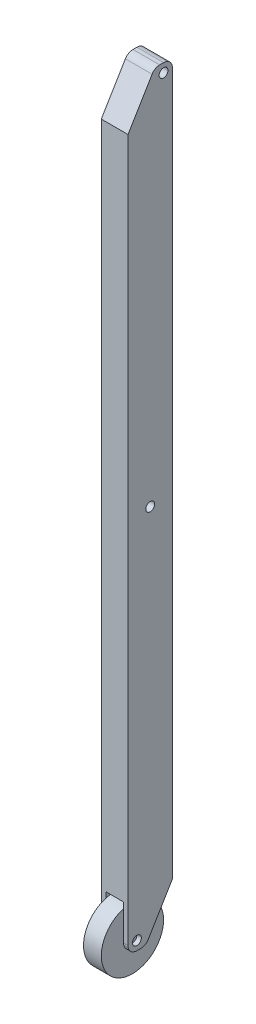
ISO-10303-21;
HEADER;
FILE_DESCRIPTION(('STEP AP214'),'2;1');
FILE_NAME('part.step','',(''),(''),'','','');
FILE_SCHEMA(('AUTOMOTIVE_DESIGN { 1 0 10303 214 1 1 1 1 }'));
ENDSEC;
DATA;
#1=APPLICATION_CONTEXT('core data for automotive mechanical design processes');
#2=APPLICATION_PROTOCOL_DEFINITION('international standard','automotive_design',2000,#1);
#3=PRODUCT_CONTEXT('',#1,'mechanical');
#4=PRODUCT('Part','Part','',(#3));
#5=PRODUCT_RELATED_PRODUCT_CATEGORY('part','',(#4));
#6=PRODUCT_DEFINITION_FORMATION('','',#4);
#7=PRODUCT_DEFINITION_CONTEXT('part definition',#1,'design');
#8=PRODUCT_DEFINITION('design','',#6,#7);
#9=PRODUCT_DEFINITION_SHAPE('','',#8);
#10=(LENGTH_UNIT() NAMED_UNIT(*) SI_UNIT(.MILLI.,.METRE.));
#11=(NAMED_UNIT(*) PLANE_ANGLE_UNIT() SI_UNIT($,.RADIAN.));
#12=(NAMED_UNIT(*) SI_UNIT($,.STERADIAN.) SOLID_ANGLE_UNIT());
#13=UNCERTAINTY_MEASURE_WITH_UNIT(LENGTH_MEASURE(1.E-05),#10,'distance_accuracy_value','');
#14=(GEOMETRIC_REPRESENTATION_CONTEXT(3) GLOBAL_UNCERTAINTY_ASSIGNED_CONTEXT((#13)) GLOBAL_UNIT_ASSIGNED_CONTEXT((#10,
#11,#12)) REPRESENTATION_CONTEXT('',''));
#15=CARTESIAN_POINT('',(0.,0.,0.));
#16=DIRECTION('',(0.,0.,1.));
#17=DIRECTION('',(1.,0.,0.));
#18=AXIS2_PLACEMENT_3D('',#15,#16,#17);
#19=CARTESIAN_POINT('',(0.,0.,50.));
#20=DIRECTION('',(0.,0.,1.));
#21=DIRECTION('',(1.,0.,0.));
#22=AXIS2_PLACEMENT_3D('',#19,#20,#21);
#23=PLANE('',#22);
#24=DIRECTION('',(-1.,0.,0.));
#25=VECTOR('',#24,1.);
#26=CARTESIAN_POINT('',(610.,-750.,50.));
#27=LINE('',#26,#25);
#28=CARTESIAN_POINT('',(610.,-750.,50.));
#29=VERTEX_POINT('',#28);
#30=CARTESIAN_POINT('',(570.,-750.,50.));
#31=VERTEX_POINT('',#30);
#32=EDGE_CURVE('E226',#29,#31,#27,.T.);
#33=ORIENTED_EDGE('',*,*,#32,.F.);
#34=DIRECTION('',(0.,1.,0.));
#35=VECTOR('',#34,1.);
#36=CARTESIAN_POINT('',(610.,0.,50.));
#37=LINE('',#36,#35);
#38=CARTESIAN_POINT('',(610.,-762.917960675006,50.));
#39=VERTEX_POINT('',#38);
#40=EDGE_CURVE('E211',#39,#29,#37,.T.);
#41=ORIENTED_EDGE('',*,*,#40,.F.);
#42=CARTESIAN_POINT('',(610.,-830.,50.));
#43=VERTEX_POINT('',#42);
#44=EDGE_CURVE('E212',#43,#39,#37,.T.);
#45=ORIENTED_EDGE('',*,*,#44,.F.);
#46=DIRECTION('',(-1.,0.,0.));
#47=VECTOR('',#46,1.);
#48=CARTESIAN_POINT('',(620.,-830.,50.));
#49=LINE('',#48,#47);
#50=CARTESIAN_POINT('',(620.,-830.,50.));
#51=VERTEX_POINT('',#50);
#52=EDGE_CURVE('E50',#43,#51,#49,.F.);
#53=ORIENTED_EDGE('',*,*,#52,.T.);
#54=DIRECTION('',(0.,-1.,0.));
#55=VECTOR('',#54,1.);
#56=CARTESIAN_POINT('',(620.,0.,50.));
#57=LINE('',#56,#55);
#58=CARTESIAN_POINT('',(620.,750.,50.));
#59=VERTEX_POINT('',#58);
#60=EDGE_CURVE('E268',#59,#51,#57,.T.);
#61=ORIENTED_EDGE('',*,*,#60,.F.);
#62=DIRECTION('',(1.,0.,0.));
#63=VECTOR('',#62,1.);
#64=CARTESIAN_POINT('',(0.,750.,50.));
#65=LINE('',#64,#63);
#66=CARTESIAN_POINT('',(560.,750.,50.));
#67=VERTEX_POINT('',#66);
#68=EDGE_CURVE('E272',#67,#59,#65,.T.);
#69=ORIENTED_EDGE('',*,*,#68,.F.);
#70=DIRECTION('',(0.,-1.,0.));
#71=VECTOR('',#70,1.);
#72=CARTESIAN_POINT('',(560.,0.,50.));
#73=LINE('',#72,#71);
#74=CARTESIAN_POINT('',(560.,-830.,50.));
#75=VERTEX_POINT('',#74);
#76=EDGE_CURVE('E266',#67,#75,#73,.T.);
#77=ORIENTED_EDGE('',*,*,#76,.T.);
#78=CARTESIAN_POINT('',(570.,-830.,50.));
#79=VERTEX_POINT('',#78);
#80=EDGE_CURVE('E11',#75,#79,#49,.F.);
#81=ORIENTED_EDGE('',*,*,#80,.T.);
#82=DIRECTION('',(0.,1.,0.));
#83=VECTOR('',#82,1.);
#84=CARTESIAN_POINT('',(570.,0.,50.));
#85=LINE('',#84,#83);
#86=CARTESIAN_POINT('',(570.,-762.917960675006,50.));
#87=VERTEX_POINT('',#86);
#88=EDGE_CURVE('E169',#79,#87,#85,.T.);
#89=ORIENTED_EDGE('',*,*,#88,.T.);
#90=EDGE_CURVE('E171',#87,#31,#85,.T.);
#91=ORIENTED_EDGE('',*,*,#90,.T.);
#92=EDGE_LOOP('',(#33,#41,#45,#53,#61,#69,#77,#81,#89,#91));
#93=FACE_BOUND('',#92,.T.);
#94=ADVANCED_FACE('F41',(#93),#23,.T.);
#95=CARTESIAN_POINT('',(620.,-850.,50.));
#96=DIRECTION('',(0.,1.,0.));
#97=DIRECTION('',(0.,0.,1.));
#98=AXIS2_PLACEMENT_3D('',#95,#96,#97);
#99=PLANE('',#98);
#100=DIRECTION('',(0.,0.,1.));
#101=VECTOR('',#100,1.);
#102=CARTESIAN_POINT('',(610.,-850.,0.));
#103=LINE('',#102,#101);
#104=CARTESIAN_POINT('',(610.,-850.,21.3238075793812));
#105=VERTEX_POINT('',#104);
#106=CARTESIAN_POINT('',(610.,-850.,30.));
#107=VERTEX_POINT('',#106);
#108=EDGE_CURVE('E207',#105,#107,#103,.T.);
#109=ORIENTED_EDGE('',*,*,#108,.F.);
#110=DIRECTION('',(-1.,0.,0.));
#111=VECTOR('',#110,1.);
#112=CARTESIAN_POINT('',(620.,-850.,21.3238075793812));
#113=LINE('',#112,#111);
#114=CARTESIAN_POINT('',(620.,-850.,21.3238075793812));
#115=VERTEX_POINT('',#114);
#116=EDGE_CURVE('E318',#105,#115,#113,.F.);
#117=ORIENTED_EDGE('',*,*,#116,.T.);
#118=DIRECTION('',(0.,0.,-1.));
#119=VECTOR('',#118,1.);
#120=CARTESIAN_POINT('',(620.,-850.,50.));
#121=LINE('',#120,#119);
#122=CARTESIAN_POINT('',(620.,-850.,30.));
#123=VERTEX_POINT('',#122);
#124=EDGE_CURVE('E241',#123,#115,#121,.T.);
#125=ORIENTED_EDGE('',*,*,#124,.F.);
#126=DIRECTION('',(-1.,0.,0.));
#127=VECTOR('',#126,1.);
#128=CARTESIAN_POINT('',(560.,-850.,30.));
#129=LINE('',#128,#127);
#130=EDGE_CURVE('E315',#123,#107,#129,.T.);
#131=ORIENTED_EDGE('',*,*,#130,.T.);
#132=EDGE_LOOP('',(#109,#117,#125,#131));
#133=FACE_BOUND('',#132,.T.);
#134=ADVANCED_FACE('F349',(#133),#99,.F.);
#135=CARTESIAN_POINT('',(620.,-850.,9.99999999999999));
#136=DIRECTION('',(0.,0.514495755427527,0.857492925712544));
#137=DIRECTION('',(0.,-0.857492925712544,0.514495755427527));
#138=AXIS2_PLACEMENT_3D('',#135,#136,#137);
#139=PLANE('',#138);
#140=DIRECTION('',(0.,-0.857492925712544,0.514495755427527));
#141=VECTOR('',#140,1.);
#142=CARTESIAN_POINT('',(610.,-220.588235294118,-367.647058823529));
#143=LINE('',#142,#141);
#144=CARTESIAN_POINT('',(610.,-750.,-50.));
#145=VERTEX_POINT('',#144);
#146=CARTESIAN_POINT('',(610.,-788.897107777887,-26.6617353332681));
#147=VERTEX_POINT('',#146);
#148=EDGE_CURVE('E202',#145,#147,#143,.T.);
#149=ORIENTED_EDGE('',*,*,#148,.F.);
#150=DIRECTION('',(1.,0.,0.));
#151=VECTOR('',#150,1.);
#152=CARTESIAN_POINT('',(0.,-750.,-50.));
#153=LINE('',#152,#151);
#154=CARTESIAN_POINT('',(620.,-750.,-50.));
#155=VERTEX_POINT('',#154);
#156=EDGE_CURVE('E278',#145,#155,#153,.T.);
#157=ORIENTED_EDGE('',*,*,#156,.T.);
#158=DIRECTION('',(0.,0.857492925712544,-0.514495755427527));
#159=VECTOR('',#158,1.);
#160=CARTESIAN_POINT('',(620.,-850.,9.99999999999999));
#161=LINE('',#160,#159);
#162=CARTESIAN_POINT('',(620.,-840.28991510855,4.17394906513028));
#163=VERTEX_POINT('',#162);
#164=EDGE_CURVE('E238',#163,#155,#161,.T.);
#165=ORIENTED_EDGE('',*,*,#164,.F.);
#166=DIRECTION('',(-1.,0.,0.));
#167=VECTOR('',#166,1.);
#168=CARTESIAN_POINT('',(620.,-840.28991510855,4.17394906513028));
#169=LINE('',#168,#167);
#170=CARTESIAN_POINT('',(610.,-840.28991510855,4.17394906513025));
#171=VERTEX_POINT('',#170);
#172=EDGE_CURVE('E307',#163,#171,#169,.T.);
#173=ORIENTED_EDGE('',*,*,#172,.T.);
#174=EDGE_CURVE('E201',#147,#171,#143,.T.);
#175=ORIENTED_EDGE('',*,*,#174,.F.);
#176=EDGE_LOOP('',(#149,#157,#165,#173,#175));
#177=FACE_BOUND('',#176,.T.);
#178=ADVANCED_FACE('F355',(#177),#139,.F.);
#179=CARTESIAN_POINT('',(620.,-830.,30.));
#180=DIRECTION('',(-1.,0.,0.));
#181=DIRECTION('',(0.,0.,1.));
#182=AXIS2_PLACEMENT_3D('',#179,#180,#181);
#183=CYLINDRICAL_SURFACE('',#182,10.);
#184=CARTESIAN_POINT('',(620.,-830.,30.));
#185=DIRECTION('',(1.,0.,0.));
#186=DIRECTION('',(0.,0.,-1.));
#187=AXIS2_PLACEMENT_3D('',#184,#185,#186);
#188=CIRCLE('',#187,10.);
#189=CARTESIAN_POINT('',(620.,-830.,40.));
#190=VERTEX_POINT('',#189);
#191=EDGE_CURVE('E230',#190,#190,#188,.T.);
#192=CARTESIAN_POINT('',(610.,-830.,30.));
#193=DIRECTION('',(-1.,0.,0.));
#194=DIRECTION('',(0.,0.,1.));
#195=AXIS2_PLACEMENT_3D('',#192,#193,#194);
#196=CIRCLE('',#195,10.);
#197=CARTESIAN_POINT('',(610.,-830.,40.));
#198=VERTEX_POINT('',#197);
#199=EDGE_CURVE('E214',#198,#198,#196,.F.);
#200=CARTESIAN_POINT('',(620.,-830.,40.));
#201=CARTESIAN_POINT('',(619.895833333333,-830.,40.));
#202=CARTESIAN_POINT('',(619.791666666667,-830.,40.));
#203=CARTESIAN_POINT('',(619.583333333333,-830.,40.));
#204=CARTESIAN_POINT('',(619.479166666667,-830.,40.));
#205=CARTESIAN_POINT('',(619.270833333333,-830.,40.));
#206=CARTESIAN_POINT('',(619.166666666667,-830.,40.));
#207=CARTESIAN_POINT('',(618.958333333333,-830.,40.));
#208=CARTESIAN_POINT('',(618.854166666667,-830.,40.));
#209=CARTESIAN_POINT('',(618.645833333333,-830.,40.));
#210=CARTESIAN_POINT('',(618.541666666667,-830.,40.));
#211=CARTESIAN_POINT('',(618.333333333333,-830.,40.));
#212=CARTESIAN_POINT('',(618.229166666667,-830.,40.));
#213=CARTESIAN_POINT('',(618.020833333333,-830.,40.));
#214=CARTESIAN_POINT('',(617.916666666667,-830.,40.));
#215=CARTESIAN_POINT('',(617.708333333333,-830.,40.));
#216=CARTESIAN_POINT('',(617.604166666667,-830.,40.));
#217=CARTESIAN_POINT('',(617.395833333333,-830.,40.));
#218=CARTESIAN_POINT('',(617.291666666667,-830.,40.));
#219=CARTESIAN_POINT('',(617.083333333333,-830.,40.));
#220=CARTESIAN_POINT('',(616.979166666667,-830.,40.));
#221=CARTESIAN_POINT('',(616.770833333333,-830.,40.));
#222=CARTESIAN_POINT('',(616.666666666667,-830.,40.));
#223=CARTESIAN_POINT('',(616.458333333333,-830.,40.));
#224=CARTESIAN_POINT('',(616.354166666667,-830.,40.));
#225=CARTESIAN_POINT('',(616.145833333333,-830.,40.));
#226=CARTESIAN_POINT('',(616.041666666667,-830.,40.));
#227=CARTESIAN_POINT('',(615.833333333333,-830.,40.));
#228=CARTESIAN_POINT('',(615.729166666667,-830.,40.));
#229=CARTESIAN_POINT('',(615.520833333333,-830.,40.));
#230=CARTESIAN_POINT('',(615.416666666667,-830.,40.));
#231=CARTESIAN_POINT('',(615.208333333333,-830.,40.));
#232=CARTESIAN_POINT('',(615.104166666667,-830.,40.));
#233=CARTESIAN_POINT('',(614.895833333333,-830.,40.));
#234=CARTESIAN_POINT('',(614.791666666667,-830.,40.));
#235=CARTESIAN_POINT('',(614.583333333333,-830.,40.));
#236=CARTESIAN_POINT('',(614.479166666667,-830.,40.));
#237=CARTESIAN_POINT('',(614.270833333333,-830.,40.));
#238=CARTESIAN_POINT('',(614.166666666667,-830.,40.));
#239=CARTESIAN_POINT('',(613.958333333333,-830.,40.));
#240=CARTESIAN_POINT('',(613.854166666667,-830.,40.));
#241=CARTESIAN_POINT('',(613.645833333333,-830.,40.));
#242=CARTESIAN_POINT('',(613.541666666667,-830.,40.));
#243=CARTESIAN_POINT('',(613.333333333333,-830.,40.));
#244=CARTESIAN_POINT('',(613.229166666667,-830.,40.));
#245=CARTESIAN_POINT('',(613.020833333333,-830.,40.));
#246=CARTESIAN_POINT('',(612.916666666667,-830.,40.));
#247=CARTESIAN_POINT('',(612.708333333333,-830.,40.));
#248=CARTESIAN_POINT('',(612.604166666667,-830.,40.));
#249=CARTESIAN_POINT('',(612.395833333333,-830.,40.));
#250=CARTESIAN_POINT('',(612.291666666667,-830.,40.));
#251=CARTESIAN_POINT('',(612.083333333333,-830.,40.));
#252=CARTESIAN_POINT('',(611.979166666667,-830.,40.));
#253=CARTESIAN_POINT('',(611.770833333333,-830.,40.));
#254=CARTESIAN_POINT('',(611.666666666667,-830.,40.));
#255=CARTESIAN_POINT('',(611.458333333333,-830.,40.));
#256=CARTESIAN_POINT('',(611.354166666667,-830.,40.));
#257=CARTESIAN_POINT('',(611.145833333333,-830.,40.));
#258=CARTESIAN_POINT('',(611.041666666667,-830.,40.));
#259=CARTESIAN_POINT('',(610.833333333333,-830.,40.));
#260=CARTESIAN_POINT('',(610.729166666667,-830.,40.));
#261=CARTESIAN_POINT('',(610.520833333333,-830.,40.));
#262=CARTESIAN_POINT('',(610.416666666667,-830.,40.));
#263=CARTESIAN_POINT('',(610.208333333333,-830.,40.));
#264=CARTESIAN_POINT('',(610.104166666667,-830.,40.));
#265=CARTESIAN_POINT('',(610.,-830.,40.));
#266=B_SPLINE_CURVE_WITH_KNOTS('',3,(#200,#201,#202,#203,#204,#205,#206,#207,#208,#209,#210,
#211,#212,#213,#214,#215,#216,#217,#218,#219,#220,#221,#222,#223,#224,#225,#226,#227,#228,#229,
#230,#231,#232,#233,#234,#235,#236,#237,#238,#239,#240,#241,#242,#243,#244,#245,#246,#247,#248,
#249,#250,#251,#252,#253,#254,#255,#256,#257,#258,#259,#260,#261,#262,#263,#264,#265),
.UNSPECIFIED.,.F.,.F.,(4,2,2,2,2,2,2,2,2,2,2,2,2,2,2,2,2,2,2,2,2,2,2,2,2,2,2,2,2,2,2,2,4),(0.,
0.312500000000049,0.625000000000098,0.937500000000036,1.25000000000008,1.56250000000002,
1.87500000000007,2.18750000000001,2.50000000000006,2.8125,3.12500000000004,3.43749999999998,
3.75000000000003,4.06249999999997,4.37500000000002,4.68749999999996,5.,5.31250000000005,
5.62499999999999,5.93750000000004,6.24999999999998,6.56250000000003,6.87499999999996,
7.18750000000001,7.49999999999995,7.8125,8.12499999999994,8.43749999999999,8.74999999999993,
9.06249999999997,9.37499999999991,9.68749999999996,10.),.UNSPECIFIED.);
#267=EDGE_CURVE('BSEAM382',#190,#198,#266,.T.);
#268=ORIENTED_EDGE('',*,*,#191,.T.);
#269=ORIENTED_EDGE('',*,*,#199,.F.);
#270=ORIENTED_EDGE('',*,*,#267,.T.);
#271=ORIENTED_EDGE('',*,*,#267,.F.);
#272=EDGE_LOOP('',(#268,#270,#269,#271));
#273=FACE_BOUND('',#272,.T.);
#274=ADVANCED_FACE('F382',(#273),#183,.F.);
#275=CARTESIAN_POINT('',(620.,-830.,21.3238075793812));
#276=DIRECTION('',(-1.,0.,0.));
#277=DIRECTION('',(0.,0.,1.));
#278=AXIS2_PLACEMENT_3D('',#275,#276,#277);
#279=CYLINDRICAL_SURFACE('',#278,20.);
#280=ORIENTED_EDGE('',*,*,#116,.F.);
#281=CARTESIAN_POINT('',(610.,-830.,21.3238075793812));
#282=DIRECTION('',(-1.,0.,0.));
#283=DIRECTION('',(0.,0.,1.));
#284=AXIS2_PLACEMENT_3D('',#281,#282,#283);
#285=CIRCLE('',#284,20.);
#286=EDGE_CURVE('E205',#171,#105,#285,.T.);
#287=ORIENTED_EDGE('',*,*,#286,.F.);
#288=ORIENTED_EDGE('',*,*,#172,.F.);
#289=CARTESIAN_POINT('',(620.,-830.,21.3238075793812));
#290=DIRECTION('',(1.,0.,0.));
#291=DIRECTION('',(0.,0.,-1.));
#292=AXIS2_PLACEMENT_3D('',#289,#290,#291);
#293=CIRCLE('',#292,20.);
#294=EDGE_CURVE('E298',#115,#163,#293,.T.);
#295=ORIENTED_EDGE('',*,*,#294,.F.);
#296=EDGE_LOOP('',(#280,#287,#288,#295));
#297=FACE_BOUND('',#296,.T.);
#298=ADVANCED_FACE('F448',(#297),#279,.T.);
#299=CARTESIAN_POINT('',(620.,-830.,30.));
#300=DIRECTION('',(1.,0.,0.));
#301=DIRECTION('',(0.,0.,-1.));
#302=AXIS2_PLACEMENT_3D('',#299,#300,#301);
#303=CYLINDRICAL_SURFACE('',#302,20.);
#304=ORIENTED_EDGE('',*,*,#52,.F.);
#305=CARTESIAN_POINT('',(610.,-830.,30.));
#306=DIRECTION('',(-1.,0.,0.));
#307=DIRECTION('',(0.,0.,1.));
#308=AXIS2_PLACEMENT_3D('',#305,#306,#307);
#309=CIRCLE('',#308,20.);
#310=EDGE_CURVE('E209',#107,#43,#309,.T.);
#311=ORIENTED_EDGE('',*,*,#310,.F.);
#312=ORIENTED_EDGE('',*,*,#130,.F.);
#313=CARTESIAN_POINT('',(620.,-830.,30.));
#314=DIRECTION('',(1.,0.,0.));
#315=DIRECTION('',(0.,0.,-1.));
#316=AXIS2_PLACEMENT_3D('',#313,#314,#315);
#317=CIRCLE('',#316,20.);
#318=EDGE_CURVE('E296',#51,#123,#317,.T.);
#319=ORIENTED_EDGE('',*,*,#318,.F.);
#320=EDGE_LOOP('',(#304,#311,#312,#319));
#321=FACE_BOUND('',#320,.T.);
#322=ADVANCED_FACE('F343',(#321),#303,.T.);
#323=CARTESIAN_POINT('',(620.,0.,50.));
#324=DIRECTION('',(1.,0.,0.));
#325=DIRECTION('',(0.,0.,-1.));
#326=AXIS2_PLACEMENT_3D('',#323,#324,#325);
#327=PLANE('',#326);
#328=CARTESIAN_POINT('',(620.,0.,0.));
#329=DIRECTION('',(1.,0.,0.));
#330=DIRECTION('',(0.,0.,-1.));
#331=AXIS2_PLACEMENT_3D('',#328,#329,#330);
#332=CIRCLE('',#331,10.);
#333=CARTESIAN_POINT('',(620.,0.,-10.));
#334=VERTEX_POINT('',#333);
#335=EDGE_CURVE('E237',#334,#334,#332,.T.);
#336=ORIENTED_EDGE('',*,*,#335,.F.);
#337=EDGE_LOOP('',(#336));
#338=FACE_BOUND('',#337,.T.);
#339=DIRECTION('',(0.,0.,1.));
#340=VECTOR('',#339,1.);
#341=CARTESIAN_POINT('',(620.,850.,-9.99999999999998));
#342=LINE('',#341,#340);
#343=CARTESIAN_POINT('',(620.,850.,-30.));
#344=VERTEX_POINT('',#343);
#345=CARTESIAN_POINT('',(620.,850.,-21.3238075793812));
#346=VERTEX_POINT('',#345);
#347=EDGE_CURVE('E257',#344,#346,#342,.T.);
#348=ORIENTED_EDGE('',*,*,#347,.T.);
#349=CARTESIAN_POINT('',(620.,830.,-21.3238075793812));
#350=DIRECTION('',(1.,0.,0.));
#351=DIRECTION('',(0.,0.,-1.));
#352=AXIS2_PLACEMENT_3D('',#349,#350,#351);
#353=CIRCLE('',#352,20.);
#354=CARTESIAN_POINT('',(620.,840.28991510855,-4.17394906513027));
#355=VERTEX_POINT('',#354);
#356=EDGE_CURVE('E302',#346,#355,#353,.T.);
#357=ORIENTED_EDGE('',*,*,#356,.T.);
#358=DIRECTION('',(0.,-0.857492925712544,0.514495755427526));
#359=VECTOR('',#358,1.);
#360=CARTESIAN_POINT('',(620.,750.,50.));
#361=LINE('',#360,#359);
#362=EDGE_CURVE('E255',#355,#59,#361,.T.);
#363=ORIENTED_EDGE('',*,*,#362,.T.);
#364=ORIENTED_EDGE('',*,*,#60,.T.);
#365=ORIENTED_EDGE('',*,*,#318,.T.);
#366=ORIENTED_EDGE('',*,*,#124,.T.);
#367=ORIENTED_EDGE('',*,*,#294,.T.);
#368=ORIENTED_EDGE('',*,*,#164,.T.);
#369=DIRECTION('',(0.,-1.,0.));
#370=VECTOR('',#369,1.);
#371=CARTESIAN_POINT('',(620.,0.,-50.));
#372=LINE('',#371,#370);
#373=CARTESIAN_POINT('',(620.,830.,-50.));
#374=VERTEX_POINT('',#373);
#375=EDGE_CURVE('E269',#374,#155,#372,.T.);
#376=ORIENTED_EDGE('',*,*,#375,.F.);
#377=CARTESIAN_POINT('',(620.,830.,-30.));
#378=DIRECTION('',(1.,0.,0.));
#379=DIRECTION('',(0.,0.,-1.));
#380=AXIS2_PLACEMENT_3D('',#377,#378,#379);
#381=CIRCLE('',#380,20.);
#382=EDGE_CURVE('E300',#374,#344,#381,.T.);
#383=ORIENTED_EDGE('',*,*,#382,.T.);
#384=EDGE_LOOP('',(#348,#357,#363,#364,#365,#366,#367,#368,#376,#383));
#385=FACE_BOUND('',#384,.T.);
#386=CARTESIAN_POINT('',(620.,830.,-30.));
#387=DIRECTION('',(1.,0.,0.));
#388=DIRECTION('',(0.,0.,-1.));
#389=AXIS2_PLACEMENT_3D('',#386,#387,#388);
#390=CIRCLE('',#389,10.);
#391=CARTESIAN_POINT('',(620.,830.,-20.));
#392=VERTEX_POINT('',#391);
#393=EDGE_CURVE('E249',#392,#392,#390,.T.);
#394=ORIENTED_EDGE('',*,*,#393,.F.);
#395=EDGE_LOOP('',(#394));
#396=FACE_BOUND('',#395,.T.);
#397=ORIENTED_EDGE('',*,*,#191,.F.);
#398=EDGE_LOOP('',(#397));
#399=FACE_BOUND('',#398,.T.);
#400=ADVANCED_FACE('F332',(#338,#385,#396,#399),#327,.T.);
#401=CARTESIAN_POINT('',(560.,0.,50.));
#402=DIRECTION('',(1.,0.,0.));
#403=DIRECTION('',(0.,0.,-1.));
#404=AXIS2_PLACEMENT_3D('',#401,#402,#403);
#405=PLANE('',#404);
#406=DIRECTION('',(0.,-0.857492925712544,0.514495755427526));
#407=VECTOR('',#406,1.);
#408=CARTESIAN_POINT('',(560.,750.,50.));
#409=LINE('',#408,#407);
#410=CARTESIAN_POINT('',(560.,840.28991510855,-4.17394906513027));
#411=VERTEX_POINT('',#410);
#412=EDGE_CURVE('E252',#411,#67,#409,.T.);
#413=ORIENTED_EDGE('',*,*,#412,.F.);
#414=CARTESIAN_POINT('',(560.,830.,-21.3238075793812));
#415=DIRECTION('',(1.,0.,0.));
#416=DIRECTION('',(0.,0.,-1.));
#417=AXIS2_PLACEMENT_3D('',#414,#415,#416);
#418=CIRCLE('',#417,20.);
#419=CARTESIAN_POINT('',(560.,850.,-21.3238075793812));
#420=VERTEX_POINT('',#419);
#421=EDGE_CURVE('E289',#411,#420,#418,.F.);
#422=ORIENTED_EDGE('',*,*,#421,.T.);
#423=DIRECTION('',(0.,0.,1.));
#424=VECTOR('',#423,1.);
#425=CARTESIAN_POINT('',(560.,850.,-9.99999999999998));
#426=LINE('',#425,#424);
#427=CARTESIAN_POINT('',(560.,850.,-30.));
#428=VERTEX_POINT('',#427);
#429=EDGE_CURVE('E258',#428,#420,#426,.T.);
#430=ORIENTED_EDGE('',*,*,#429,.F.);
#431=CARTESIAN_POINT('',(560.,830.,-30.));
#432=DIRECTION('',(1.,0.,0.));
#433=DIRECTION('',(0.,0.,-1.));
#434=AXIS2_PLACEMENT_3D('',#431,#432,#433);
#435=CIRCLE('',#434,20.);
#436=CARTESIAN_POINT('',(560.,830.,-50.));
#437=VERTEX_POINT('',#436);
#438=EDGE_CURVE('E286',#428,#437,#435,.F.);
#439=ORIENTED_EDGE('',*,*,#438,.T.);
#440=DIRECTION('',(0.,-1.,0.));
#441=VECTOR('',#440,1.);
#442=CARTESIAN_POINT('',(560.,0.,-50.));
#443=LINE('',#442,#441);
#444=CARTESIAN_POINT('',(560.,-750.,-50.));
#445=VERTEX_POINT('',#444);
#446=EDGE_CURVE('E261',#437,#445,#443,.T.);
#447=ORIENTED_EDGE('',*,*,#446,.T.);
#448=DIRECTION('',(0.,0.857492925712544,-0.514495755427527));
#449=VECTOR('',#448,1.);
#450=CARTESIAN_POINT('',(560.,-850.,9.99999999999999));
#451=LINE('',#450,#449);
#452=CARTESIAN_POINT('',(560.,-840.28991510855,4.17394906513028));
#453=VERTEX_POINT('',#452);
#454=EDGE_CURVE('E233',#453,#445,#451,.T.);
#455=ORIENTED_EDGE('',*,*,#454,.F.);
#456=CARTESIAN_POINT('',(560.,-830.,21.3238075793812));
#457=DIRECTION('',(1.,0.,0.));
#458=DIRECTION('',(0.,0.,-1.));
#459=AXIS2_PLACEMENT_3D('',#456,#457,#458);
#460=CIRCLE('',#459,20.);
#461=CARTESIAN_POINT('',(560.,-850.,21.3238075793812));
#462=VERTEX_POINT('',#461);
#463=EDGE_CURVE('E312',#453,#462,#460,.F.);
#464=ORIENTED_EDGE('',*,*,#463,.T.);
#465=DIRECTION('',(0.,0.,-1.));
#466=VECTOR('',#465,1.);
#467=CARTESIAN_POINT('',(560.,-850.,50.));
#468=LINE('',#467,#466);
#469=CARTESIAN_POINT('',(560.,-850.,30.));
#470=VERTEX_POINT('',#469);
#471=EDGE_CURVE('E242',#470,#462,#468,.T.);
#472=ORIENTED_EDGE('',*,*,#471,.F.);
#473=CARTESIAN_POINT('',(560.,-830.,30.));
#474=DIRECTION('',(1.,0.,0.));
#475=DIRECTION('',(0.,0.,-1.));
#476=AXIS2_PLACEMENT_3D('',#473,#474,#475);
#477=CIRCLE('',#476,20.);
#478=EDGE_CURVE('E310',#470,#75,#477,.F.);
#479=ORIENTED_EDGE('',*,*,#478,.T.);
#480=ORIENTED_EDGE('',*,*,#76,.F.);
#481=EDGE_LOOP('',(#413,#422,#430,#439,#447,#455,#464,#472,#479,#480));
#482=FACE_BOUND('',#481,.T.);
#483=CARTESIAN_POINT('',(560.,830.,-30.));
#484=DIRECTION('',(1.,0.,0.));
#485=DIRECTION('',(0.,0.,-1.));
#486=AXIS2_PLACEMENT_3D('',#483,#484,#485);
#487=CIRCLE('',#486,10.);
#488=CARTESIAN_POINT('',(560.,830.,-20.));
#489=VERTEX_POINT('',#488);
#490=EDGE_CURVE('E245',#489,#489,#487,.T.);
#491=ORIENTED_EDGE('',*,*,#490,.T.);
#492=EDGE_LOOP('',(#491));
#493=FACE_BOUND('',#492,.T.);
#494=CARTESIAN_POINT('',(560.,-830.,30.));
#495=DIRECTION('',(1.,0.,0.));
#496=DIRECTION('',(0.,0.,-1.));
#497=AXIS2_PLACEMENT_3D('',#494,#495,#496);
#498=CIRCLE('',#497,10.);
#499=CARTESIAN_POINT('',(560.,-830.,40.));
#500=VERTEX_POINT('',#499);
#501=EDGE_CURVE('E234',#500,#500,#498,.T.);
#502=ORIENTED_EDGE('',*,*,#501,.T.);
#503=EDGE_LOOP('',(#502));
#504=FACE_BOUND('',#503,.T.);
#505=CARTESIAN_POINT('',(560.,0.,0.));
#506=DIRECTION('',(1.,0.,0.));
#507=DIRECTION('',(0.,0.,-1.));
#508=AXIS2_PLACEMENT_3D('',#505,#506,#507);
#509=CIRCLE('',#508,10.);
#510=CARTESIAN_POINT('',(560.,0.,-10.));
#511=VERTEX_POINT('',#510);
#512=EDGE_CURVE('E45',#511,#511,#509,.F.);
#513=ORIENTED_EDGE('',*,*,#512,.F.);
#514=EDGE_LOOP('',(#513));
#515=FACE_BOUND('',#514,.T.);
#516=ADVANCED_FACE('F329',(#482,#493,#504,#515),#405,.F.);
#517=CARTESIAN_POINT('',(0.,0.,-50.));
#518=DIRECTION('',(0.,0.,1.));
#519=DIRECTION('',(1.,0.,0.));
#520=AXIS2_PLACEMENT_3D('',#517,#518,#519);
#521=PLANE('',#520);
#522=ORIENTED_EDGE('',*,*,#446,.F.);
#523=DIRECTION('',(-1.,0.,0.));
#524=VECTOR('',#523,1.);
#525=CARTESIAN_POINT('',(0.,830.,-50.));
#526=LINE('',#525,#524);
#527=EDGE_CURVE('E304',#437,#374,#526,.F.);
#528=ORIENTED_EDGE('',*,*,#527,.T.);
#529=ORIENTED_EDGE('',*,*,#375,.T.);
#530=ORIENTED_EDGE('',*,*,#156,.F.);
#531=DIRECTION('',(-1.,0.,0.));
#532=VECTOR('',#531,1.);
#533=CARTESIAN_POINT('',(610.,-750.,-50.));
#534=LINE('',#533,#532);
#535=CARTESIAN_POINT('',(570.,-750.,-50.));
#536=VERTEX_POINT('',#535);
#537=EDGE_CURVE('E217',#145,#536,#534,.T.);
#538=ORIENTED_EDGE('',*,*,#537,.T.);
#539=EDGE_CURVE('E279',#445,#536,#153,.T.);
#540=ORIENTED_EDGE('',*,*,#539,.F.);
#541=EDGE_LOOP('',(#522,#528,#529,#530,#538,#540));
#542=FACE_BOUND('',#541,.T.);
#543=ADVANCED_FACE('F331',(#542),#521,.F.);
#544=CARTESIAN_POINT('',(620.,850.,-9.99999999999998));
#545=DIRECTION('',(0.,-1.,0.));
#546=DIRECTION('',(0.,0.,-1.));
#547=AXIS2_PLACEMENT_3D('',#544,#545,#546);
#548=PLANE('',#547);
#549=ORIENTED_EDGE('',*,*,#429,.T.);
#550=DIRECTION('',(-1.,0.,0.));
#551=VECTOR('',#550,1.);
#552=CARTESIAN_POINT('',(620.,850.,-21.3238075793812));
#553=LINE('',#552,#551);
#554=EDGE_CURVE('E294',#420,#346,#553,.F.);
#555=ORIENTED_EDGE('',*,*,#554,.T.);
#556=ORIENTED_EDGE('',*,*,#347,.F.);
#557=DIRECTION('',(-1.,0.,0.));
#558=VECTOR('',#557,1.);
#559=CARTESIAN_POINT('',(620.,850.,-30.));
#560=LINE('',#559,#558);
#561=EDGE_CURVE('E291',#344,#428,#560,.T.);
#562=ORIENTED_EDGE('',*,*,#561,.T.);
#563=EDGE_LOOP('',(#549,#555,#556,#562));
#564=FACE_BOUND('',#563,.T.);
#565=ADVANCED_FACE('F340',(#564),#548,.F.);
#566=CARTESIAN_POINT('',(620.,750.,50.));
#567=DIRECTION('',(0.,-0.514495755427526,-0.857492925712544));
#568=DIRECTION('',(0.,0.857492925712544,-0.514495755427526));
#569=AXIS2_PLACEMENT_3D('',#566,#567,#568);
#570=PLANE('',#569);
#571=ORIENTED_EDGE('',*,*,#362,.F.);
#572=DIRECTION('',(-1.,0.,0.));
#573=VECTOR('',#572,1.);
#574=CARTESIAN_POINT('',(620.,840.28991510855,-4.17394906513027));
#575=LINE('',#574,#573);
#576=EDGE_CURVE('E275',#355,#411,#575,.T.);
#577=ORIENTED_EDGE('',*,*,#576,.T.);
#578=ORIENTED_EDGE('',*,*,#412,.T.);
#579=ORIENTED_EDGE('',*,*,#68,.T.);
#580=EDGE_LOOP('',(#571,#577,#578,#579));
#581=FACE_BOUND('',#580,.T.);
#582=ADVANCED_FACE('F360',(#581),#570,.F.);
#583=CARTESIAN_POINT('',(620.,830.,-30.));
#584=DIRECTION('',(-1.,0.,0.));
#585=DIRECTION('',(0.,0.,1.));
#586=AXIS2_PLACEMENT_3D('',#583,#584,#585);
#587=CYLINDRICAL_SURFACE('',#586,10.);
#588=CARTESIAN_POINT('',(620.,830.,-20.));
#589=CARTESIAN_POINT('',(619.375,830.,-20.));
#590=CARTESIAN_POINT('',(618.75,830.,-20.));
#591=CARTESIAN_POINT('',(617.5,830.,-20.));
#592=CARTESIAN_POINT('',(616.875,830.,-20.));
#593=CARTESIAN_POINT('',(615.625,830.,-20.));
#594=CARTESIAN_POINT('',(615.,830.,-20.));
#595=CARTESIAN_POINT('',(613.75,830.,-20.));
#596=CARTESIAN_POINT('',(613.125,830.,-20.));
#597=CARTESIAN_POINT('',(611.875,830.,-20.));
#598=CARTESIAN_POINT('',(611.25,830.,-20.));
#599=CARTESIAN_POINT('',(610.,830.,-20.));
#600=CARTESIAN_POINT('',(609.375,830.,-20.));
#601=CARTESIAN_POINT('',(608.125,830.,-20.));
#602=CARTESIAN_POINT('',(607.5,830.,-20.));
#603=CARTESIAN_POINT('',(606.25,830.,-20.));
#604=CARTESIAN_POINT('',(605.625,830.,-20.));
#605=CARTESIAN_POINT('',(604.375,830.,-20.));
#606=CARTESIAN_POINT('',(603.75,830.,-20.));
#607=CARTESIAN_POINT('',(602.5,830.,-20.));
#608=CARTESIAN_POINT('',(601.875,830.,-20.));
#609=CARTESIAN_POINT('',(600.625,830.,-20.));
#610=CARTESIAN_POINT('',(600.,830.,-20.));
#611=CARTESIAN_POINT('',(598.75,830.,-20.));
#612=CARTESIAN_POINT('',(598.125,830.,-20.));
#613=CARTESIAN_POINT('',(596.875,830.,-20.));
#614=CARTESIAN_POINT('',(596.25,830.,-20.));
#615=CARTESIAN_POINT('',(595.,830.,-20.));
#616=CARTESIAN_POINT('',(594.375,830.,-20.));
#617=CARTESIAN_POINT('',(593.125,830.,-20.));
#618=CARTESIAN_POINT('',(592.5,830.,-20.));
#619=CARTESIAN_POINT('',(591.25,830.,-20.));
#620=CARTESIAN_POINT('',(590.625,830.,-20.));
#621=CARTESIAN_POINT('',(589.375,830.,-20.));
#622=CARTESIAN_POINT('',(588.75,830.,-20.));
#623=CARTESIAN_POINT('',(587.5,830.,-20.));
#624=CARTESIAN_POINT('',(586.875,830.,-20.));
#625=CARTESIAN_POINT('',(585.625,830.,-20.));
#626=CARTESIAN_POINT('',(585.,830.,-20.));
#627=CARTESIAN_POINT('',(583.75,830.,-20.));
#628=CARTESIAN_POINT('',(583.125,830.,-20.));
#629=CARTESIAN_POINT('',(581.875,830.,-20.));
#630=CARTESIAN_POINT('',(581.25,830.,-20.));
#631=CARTESIAN_POINT('',(580.,830.,-20.));
#632=CARTESIAN_POINT('',(579.375,830.,-20.));
#633=CARTESIAN_POINT('',(578.125,830.,-20.));
#634=CARTESIAN_POINT('',(577.5,830.,-20.));
#635=CARTESIAN_POINT('',(576.25,830.,-20.));
#636=CARTESIAN_POINT('',(575.625,830.,-20.));
#637=CARTESIAN_POINT('',(574.375,830.,-20.));
#638=CARTESIAN_POINT('',(573.75,830.,-20.));
#639=CARTESIAN_POINT('',(572.5,830.,-20.));
#640=CARTESIAN_POINT('',(571.875,830.,-20.));
#641=CARTESIAN_POINT('',(570.625,830.,-20.));
#642=CARTESIAN_POINT('',(570.,830.,-20.));
#643=CARTESIAN_POINT('',(568.75,830.,-20.));
#644=CARTESIAN_POINT('',(568.125,830.,-20.));
#645=CARTESIAN_POINT('',(566.875,830.,-20.));
#646=CARTESIAN_POINT('',(566.25,830.,-20.));
#647=CARTESIAN_POINT('',(565.,830.,-20.));
#648=CARTESIAN_POINT('',(564.375,830.,-20.));
#649=CARTESIAN_POINT('',(563.125,830.,-20.));
#650=CARTESIAN_POINT('',(562.5,830.,-20.));
#651=CARTESIAN_POINT('',(561.25,830.,-20.));
#652=CARTESIAN_POINT('',(560.625,830.,-20.));
#653=CARTESIAN_POINT('',(560.,830.,-20.));
#654=B_SPLINE_CURVE_WITH_KNOTS('',3,(#588,#589,#590,#591,#592,#593,#594,#595,#596,#597,#598,
#599,#600,#601,#602,#603,#604,#605,#606,#607,#608,#609,#610,#611,#612,#613,#614,#615,#616,#617,
#618,#619,#620,#621,#622,#623,#624,#625,#626,#627,#628,#629,#630,#631,#632,#633,#634,#635,#636,
#637,#638,#639,#640,#641,#642,#643,#644,#645,#646,#647,#648,#649,#650,#651,#652,#653),
.UNSPECIFIED.,.F.,.F.,(4,2,2,2,2,2,2,2,2,2,2,2,2,2,2,2,2,2,2,2,2,2,2,2,2,2,2,2,2,2,2,2,4),(0.,
1.87500000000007,3.75000000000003,5.6250000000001,7.50000000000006,9.37500000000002,
11.2500000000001,13.1250000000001,15.,16.8750000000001,18.75,20.6250000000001,22.5000000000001,
24.375,26.2500000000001,28.1250000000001,30.,31.8750000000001,33.7500000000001,35.6250000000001,
37.5000000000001,39.375,41.2500000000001,43.1250000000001,45.,46.8750000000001,48.7500000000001,
50.6250000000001,52.5000000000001,54.3750000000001,56.2500000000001,58.1250000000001,
60.0000000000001),.UNSPECIFIED.);
#655=EDGE_CURVE('BSEAM363',#392,#489,#654,.T.);
#656=ORIENTED_EDGE('',*,*,#393,.T.);
#657=ORIENTED_EDGE('',*,*,#490,.F.);
#658=ORIENTED_EDGE('',*,*,#655,.T.);
#659=ORIENTED_EDGE('',*,*,#655,.F.);
#660=EDGE_LOOP('',(#656,#658,#657,#659));
#661=FACE_BOUND('',#660,.T.);
#662=ADVANCED_FACE('F363',(#661),#587,.F.);
#663=CARTESIAN_POINT('',(570.,-850.,21.3238075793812));
#664=VERTEX_POINT('',#663);
#665=EDGE_CURVE('E319',#462,#664,#113,.F.);
#666=ORIENTED_EDGE('',*,*,#665,.T.);
#667=DIRECTION('',(0.,0.,1.));
#668=VECTOR('',#667,1.);
#669=CARTESIAN_POINT('',(570.,-850.,0.));
#670=LINE('',#669,#668);
#671=CARTESIAN_POINT('',(570.,-850.,30.));
#672=VERTEX_POINT('',#671);
#673=EDGE_CURVE('E223',#664,#672,#670,.T.);
#674=ORIENTED_EDGE('',*,*,#673,.T.);
#675=EDGE_CURVE('E314',#672,#470,#129,.T.);
#676=ORIENTED_EDGE('',*,*,#675,.T.);
#677=ORIENTED_EDGE('',*,*,#471,.T.);
#678=EDGE_LOOP('',(#666,#674,#676,#677));
#679=FACE_BOUND('',#678,.T.);
#680=ADVANCED_FACE('F358',(#679),#99,.F.);
#681=ORIENTED_EDGE('',*,*,#539,.T.);
#682=DIRECTION('',(0.,-0.857492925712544,0.514495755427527));
#683=VECTOR('',#682,1.);
#684=CARTESIAN_POINT('',(570.,-220.588235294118,-367.647058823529));
#685=LINE('',#684,#683);
#686=CARTESIAN_POINT('',(570.,-788.897107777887,-26.6617353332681));
#687=VERTEX_POINT('',#686);
#688=EDGE_CURVE('E219',#536,#687,#685,.T.);
#689=ORIENTED_EDGE('',*,*,#688,.T.);
#690=CARTESIAN_POINT('',(570.,-840.28991510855,4.17394906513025));
#691=VERTEX_POINT('',#690);
#692=EDGE_CURVE('E189',#687,#691,#685,.T.);
#693=ORIENTED_EDGE('',*,*,#692,.T.);
#694=EDGE_CURVE('E306',#691,#453,#169,.T.);
#695=ORIENTED_EDGE('',*,*,#694,.T.);
#696=ORIENTED_EDGE('',*,*,#454,.T.);
#697=EDGE_LOOP('',(#681,#689,#693,#695,#696));
#698=FACE_BOUND('',#697,.T.);
#699=ADVANCED_FACE('F371',(#698),#139,.F.);
#700=CARTESIAN_POINT('',(570.,-830.,30.));
#701=DIRECTION('',(-1.,0.,0.));
#702=DIRECTION('',(0.,0.,1.));
#703=AXIS2_PLACEMENT_3D('',#700,#701,#702);
#704=CIRCLE('',#703,10.);
#705=CARTESIAN_POINT('',(570.,-830.,40.));
#706=VERTEX_POINT('',#705);
#707=EDGE_CURVE('E194',#706,#706,#704,.T.);
#708=CARTESIAN_POINT('',(570.,-830.,40.));
#709=CARTESIAN_POINT('',(569.895833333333,-830.,40.));
#710=CARTESIAN_POINT('',(569.791666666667,-830.,40.));
#711=CARTESIAN_POINT('',(569.583333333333,-830.,40.));
#712=CARTESIAN_POINT('',(569.479166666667,-830.,40.));
#713=CARTESIAN_POINT('',(569.270833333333,-830.,40.));
#714=CARTESIAN_POINT('',(569.166666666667,-830.,40.));
#715=CARTESIAN_POINT('',(568.958333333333,-830.,40.));
#716=CARTESIAN_POINT('',(568.854166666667,-830.,40.));
#717=CARTESIAN_POINT('',(568.645833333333,-830.,40.));
#718=CARTESIAN_POINT('',(568.541666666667,-830.,40.));
#719=CARTESIAN_POINT('',(568.333333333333,-830.,40.));
#720=CARTESIAN_POINT('',(568.229166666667,-830.,40.));
#721=CARTESIAN_POINT('',(568.020833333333,-830.,40.));
#722=CARTESIAN_POINT('',(567.916666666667,-830.,40.));
#723=CARTESIAN_POINT('',(567.708333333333,-830.,40.));
#724=CARTESIAN_POINT('',(567.604166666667,-830.,40.));
#725=CARTESIAN_POINT('',(567.395833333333,-830.,40.));
#726=CARTESIAN_POINT('',(567.291666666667,-830.,40.));
#727=CARTESIAN_POINT('',(567.083333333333,-830.,40.));
#728=CARTESIAN_POINT('',(566.979166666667,-830.,40.));
#729=CARTESIAN_POINT('',(566.770833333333,-830.,40.));
#730=CARTESIAN_POINT('',(566.666666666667,-830.,40.));
#731=CARTESIAN_POINT('',(566.458333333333,-830.,40.));
#732=CARTESIAN_POINT('',(566.354166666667,-830.,40.));
#733=CARTESIAN_POINT('',(566.145833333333,-830.,40.));
#734=CARTESIAN_POINT('',(566.041666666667,-830.,40.));
#735=CARTESIAN_POINT('',(565.833333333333,-830.,40.));
#736=CARTESIAN_POINT('',(565.729166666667,-830.,40.));
#737=CARTESIAN_POINT('',(565.520833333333,-830.,40.));
#738=CARTESIAN_POINT('',(565.416666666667,-830.,40.));
#739=CARTESIAN_POINT('',(565.208333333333,-830.,40.));
#740=CARTESIAN_POINT('',(565.104166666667,-830.,40.));
#741=CARTESIAN_POINT('',(564.895833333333,-830.,40.));
#742=CARTESIAN_POINT('',(564.791666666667,-830.,40.));
#743=CARTESIAN_POINT('',(564.583333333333,-830.,40.));
#744=CARTESIAN_POINT('',(564.479166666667,-830.,40.));
#745=CARTESIAN_POINT('',(564.270833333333,-830.,40.));
#746=CARTESIAN_POINT('',(564.166666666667,-830.,40.));
#747=CARTESIAN_POINT('',(563.958333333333,-830.,40.));
#748=CARTESIAN_POINT('',(563.854166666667,-830.,40.));
#749=CARTESIAN_POINT('',(563.645833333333,-830.,40.));
#750=CARTESIAN_POINT('',(563.541666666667,-830.,40.));
#751=CARTESIAN_POINT('',(563.333333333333,-830.,40.));
#752=CARTESIAN_POINT('',(563.229166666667,-830.,40.));
#753=CARTESIAN_POINT('',(563.020833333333,-830.,40.));
#754=CARTESIAN_POINT('',(562.916666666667,-830.,40.));
#755=CARTESIAN_POINT('',(562.708333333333,-830.,40.));
#756=CARTESIAN_POINT('',(562.604166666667,-830.,40.));
#757=CARTESIAN_POINT('',(562.395833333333,-830.,40.));
#758=CARTESIAN_POINT('',(562.291666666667,-830.,40.));
#759=CARTESIAN_POINT('',(562.083333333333,-830.,40.));
#760=CARTESIAN_POINT('',(561.979166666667,-830.,40.));
#761=CARTESIAN_POINT('',(561.770833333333,-830.,40.));
#762=CARTESIAN_POINT('',(561.666666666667,-830.,40.));
#763=CARTESIAN_POINT('',(561.458333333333,-830.,40.));
#764=CARTESIAN_POINT('',(561.354166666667,-830.,40.));
#765=CARTESIAN_POINT('',(561.145833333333,-830.,40.));
#766=CARTESIAN_POINT('',(561.041666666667,-830.,40.));
#767=CARTESIAN_POINT('',(560.833333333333,-830.,40.));
#768=CARTESIAN_POINT('',(560.729166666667,-830.,40.));
#769=CARTESIAN_POINT('',(560.520833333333,-830.,40.));
#770=CARTESIAN_POINT('',(560.416666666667,-830.,40.));
#771=CARTESIAN_POINT('',(560.208333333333,-830.,40.));
#772=CARTESIAN_POINT('',(560.104166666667,-830.,40.));
#773=CARTESIAN_POINT('',(560.,-830.,40.));
#774=B_SPLINE_CURVE_WITH_KNOTS('',3,(#708,#709,#710,#711,#712,#713,#714,#715,#716,#717,#718,
#719,#720,#721,#722,#723,#724,#725,#726,#727,#728,#729,#730,#731,#732,#733,#734,#735,#736,#737,
#738,#739,#740,#741,#742,#743,#744,#745,#746,#747,#748,#749,#750,#751,#752,#753,#754,#755,#756,
#757,#758,#759,#760,#761,#762,#763,#764,#765,#766,#767,#768,#769,#770,#771,#772,#773),
.UNSPECIFIED.,.F.,.F.,(4,2,2,2,2,2,2,2,2,2,2,2,2,2,2,2,2,2,2,2,2,2,2,2,2,2,2,2,2,2,2,2,4),(0.,
0.312499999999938,0.624999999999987,0.937499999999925,1.24999999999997,1.56250000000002,
1.87499999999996,2.18750000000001,2.49999999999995,2.8125,3.12499999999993,3.43749999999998,
3.75000000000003,4.06249999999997,4.37500000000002,4.68749999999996,5.,5.31250000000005,
5.62499999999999,5.93750000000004,6.24999999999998,6.56250000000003,6.87500000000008,
7.18750000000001,7.50000000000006,7.8125,8.12500000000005,8.43749999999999,8.75000000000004,
9.06250000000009,9.37500000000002,9.68750000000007,10.),.UNSPECIFIED.);
#775=EDGE_CURVE('BSEAM373',#706,#500,#774,.T.);
#776=ORIENTED_EDGE('',*,*,#707,.F.);
#777=ORIENTED_EDGE('',*,*,#501,.F.);
#778=ORIENTED_EDGE('',*,*,#775,.T.);
#779=ORIENTED_EDGE('',*,*,#775,.F.);
#780=EDGE_LOOP('',(#776,#778,#777,#779));
#781=FACE_BOUND('',#780,.T.);
#782=ADVANCED_FACE('F373',(#781),#183,.F.);
#783=CARTESIAN_POINT('',(620.,830.,-21.3238075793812));
#784=DIRECTION('',(-1.,0.,0.));
#785=DIRECTION('',(0.,0.,1.));
#786=AXIS2_PLACEMENT_3D('',#783,#784,#785);
#787=CYLINDRICAL_SURFACE('',#786,20.);
#788=ORIENTED_EDGE('',*,*,#356,.F.);
#789=ORIENTED_EDGE('',*,*,#554,.F.);
#790=ORIENTED_EDGE('',*,*,#421,.F.);
#791=ORIENTED_EDGE('',*,*,#576,.F.);
#792=EDGE_LOOP('',(#788,#789,#790,#791));
#793=FACE_BOUND('',#792,.T.);
#794=ADVANCED_FACE('F380',(#793),#787,.T.);
#795=CARTESIAN_POINT('',(620.,830.,-30.));
#796=DIRECTION('',(-1.,0.,0.));
#797=DIRECTION('',(0.,0.,1.));
#798=AXIS2_PLACEMENT_3D('',#795,#796,#797);
#799=CYLINDRICAL_SURFACE('',#798,20.);
#800=ORIENTED_EDGE('',*,*,#382,.F.);
#801=ORIENTED_EDGE('',*,*,#527,.F.);
#802=ORIENTED_EDGE('',*,*,#438,.F.);
#803=ORIENTED_EDGE('',*,*,#561,.F.);
#804=EDGE_LOOP('',(#800,#801,#802,#803));
#805=FACE_BOUND('',#804,.T.);
#806=ADVANCED_FACE('F446',(#805),#799,.T.);
#807=CARTESIAN_POINT('',(570.,-830.,21.3238075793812));
#808=DIRECTION('',(-1.,0.,0.));
#809=DIRECTION('',(0.,0.,1.));
#810=AXIS2_PLACEMENT_3D('',#807,#808,#809);
#811=CIRCLE('',#810,20.);
#812=EDGE_CURVE('E221',#691,#664,#811,.T.);
#813=ORIENTED_EDGE('',*,*,#812,.T.);
#814=ORIENTED_EDGE('',*,*,#665,.F.);
#815=ORIENTED_EDGE('',*,*,#463,.F.);
#816=ORIENTED_EDGE('',*,*,#694,.F.);
#817=EDGE_LOOP('',(#813,#814,#815,#816));
#818=FACE_BOUND('',#817,.T.);
#819=ADVANCED_FACE('F439',(#818),#279,.T.);
#820=CARTESIAN_POINT('',(570.,-830.,30.));
#821=DIRECTION('',(-1.,0.,0.));
#822=DIRECTION('',(0.,0.,1.));
#823=AXIS2_PLACEMENT_3D('',#820,#821,#822);
#824=CIRCLE('',#823,20.);
#825=EDGE_CURVE('E183',#672,#79,#824,.T.);
#826=ORIENTED_EDGE('',*,*,#825,.T.);
#827=ORIENTED_EDGE('',*,*,#80,.F.);
#828=ORIENTED_EDGE('',*,*,#478,.F.);
#829=ORIENTED_EDGE('',*,*,#675,.F.);
#830=EDGE_LOOP('',(#826,#827,#828,#829));
#831=FACE_BOUND('',#830,.T.);
#832=ADVANCED_FACE('F43',(#831),#303,.T.);
#833=CARTESIAN_POINT('',(-750.,0.,0.));
#834=DIRECTION('',(1.,0.,0.));
#835=DIRECTION('',(0.,0.,-1.));
#836=AXIS2_PLACEMENT_3D('',#833,#834,#835);
#837=CYLINDRICAL_SURFACE('',#836,10.);
#838=ORIENTED_EDGE('',*,*,#512,.T.);
#839=EDGE_LOOP('',(#838));
#840=FACE_BOUND('',#839,.T.);
#841=ORIENTED_EDGE('',*,*,#335,.T.);
#842=EDGE_LOOP('',(#841));
#843=FACE_BOUND('',#842,.T.);
#844=ADVANCED_FACE('F327',(#840,#843),#837,.F.);
#845=CARTESIAN_POINT('',(610.,-750.,0.));
#846=DIRECTION('',(0.,-1.,0.));
#847=DIRECTION('',(0.,0.,-1.));
#848=AXIS2_PLACEMENT_3D('',#845,#846,#847);
#849=PLANE('',#848);
#850=DIRECTION('',(0.,0.,1.));
#851=VECTOR('',#850,1.);
#852=CARTESIAN_POINT('',(570.,-750.,0.));
#853=LINE('',#852,#851);
#854=EDGE_CURVE('E182',#536,#31,#853,.T.);
#855=ORIENTED_EDGE('',*,*,#854,.F.);
#856=ORIENTED_EDGE('',*,*,#537,.F.);
#857=DIRECTION('',(0.,0.,1.));
#858=VECTOR('',#857,1.);
#859=CARTESIAN_POINT('',(610.,-750.,0.));
#860=LINE('',#859,#858);
#861=EDGE_CURVE('E178',#145,#29,#860,.T.);
#862=ORIENTED_EDGE('',*,*,#861,.T.);
#863=ORIENTED_EDGE('',*,*,#32,.T.);
#864=EDGE_LOOP('',(#855,#856,#862,#863));
#865=FACE_BOUND('',#864,.T.);
#866=ADVANCED_FACE('F384',(#865),#849,.T.);
#867=CARTESIAN_POINT('',(610.,0.,0.));
#868=DIRECTION('',(-1.,0.,0.));
#869=DIRECTION('',(0.,0.,1.));
#870=AXIS2_PLACEMENT_3D('',#867,#868,#869);
#871=PLANE('',#870);
#872=ORIENTED_EDGE('',*,*,#148,.T.);
#873=CARTESIAN_POINT('',(610.,-830.,30.));
#874=DIRECTION('',(-1.,0.,0.));
#875=DIRECTION('',(0.,0.,1.));
#876=AXIS2_PLACEMENT_3D('',#873,#874,#875);
#877=CIRCLE('',#876,70.);
#878=EDGE_CURVE('E191',#39,#147,#877,.T.);
#879=ORIENTED_EDGE('',*,*,#878,.F.);
#880=ORIENTED_EDGE('',*,*,#40,.T.);
#881=ORIENTED_EDGE('',*,*,#861,.F.);
#882=EDGE_LOOP('',(#872,#879,#880,#881));
#883=FACE_BOUND('',#882,.T.);
#884=ADVANCED_FACE('F386',(#883),#871,.T.);
#885=CARTESIAN_POINT('',(570.,0.,0.));
#886=DIRECTION('',(-1.,0.,0.));
#887=DIRECTION('',(0.,0.,1.));
#888=AXIS2_PLACEMENT_3D('',#885,#886,#887);
#889=PLANE('',#888);
#890=CARTESIAN_POINT('',(570.,-830.,30.));
#891=DIRECTION('',(-1.,0.,0.));
#892=DIRECTION('',(0.,0.,1.));
#893=AXIS2_PLACEMENT_3D('',#890,#891,#892);
#894=CIRCLE('',#893,70.);
#895=EDGE_CURVE('E65',#87,#687,#894,.T.);
#896=ORIENTED_EDGE('',*,*,#895,.T.);
#897=ORIENTED_EDGE('',*,*,#688,.F.);
#898=ORIENTED_EDGE('',*,*,#854,.T.);
#899=ORIENTED_EDGE('',*,*,#90,.F.);
#900=EDGE_LOOP('',(#896,#897,#898,#899));
#901=FACE_BOUND('',#900,.T.);
#902=ADVANCED_FACE('F181',(#901),#889,.F.);
#903=CARTESIAN_POINT('',(570.,-830.,30.));
#904=DIRECTION('',(1.,0.,0.));
#905=DIRECTION('',(0.,0.,-1.));
#906=AXIS2_PLACEMENT_3D('',#903,#904,#905);
#907=CYLINDRICAL_SURFACE('',#906,70.);
#908=ORIENTED_EDGE('',*,*,#895,.F.);
#909=EDGE_CURVE('E186',#687,#87,#894,.T.);
#910=ORIENTED_EDGE('',*,*,#909,.F.);
#911=EDGE_LOOP('',(#908,#910));
#912=FACE_BOUND('',#911,.T.);
#913=ORIENTED_EDGE('',*,*,#878,.T.);
#914=EDGE_CURVE('E57',#147,#39,#877,.T.);
#915=ORIENTED_EDGE('',*,*,#914,.T.);
#916=EDGE_LOOP('',(#913,#915));
#917=FACE_BOUND('',#916,.T.);
#918=ADVANCED_FACE('F193',(#912,#917),#907,.T.);
#919=CARTESIAN_POINT('',(570.,-830.,30.));
#920=DIRECTION('',(-1.,0.,0.));
#921=DIRECTION('',(0.,0.,1.));
#922=AXIS2_PLACEMENT_3D('',#919,#920,#921);
#923=PLANE('',#922);
#924=ORIENTED_EDGE('',*,*,#692,.F.);
#925=ORIENTED_EDGE('',*,*,#909,.T.);
#926=ORIENTED_EDGE('',*,*,#88,.F.);
#927=ORIENTED_EDGE('',*,*,#825,.F.);
#928=ORIENTED_EDGE('',*,*,#673,.F.);
#929=ORIENTED_EDGE('',*,*,#812,.F.);
#930=EDGE_LOOP('',(#924,#925,#926,#927,#928,#929));
#931=FACE_BOUND('',#930,.T.);
#932=ADVANCED_FACE('F187',(#931),#923,.T.);
#933=CARTESIAN_POINT('',(610.,-830.,30.));
#934=DIRECTION('',(-1.,0.,0.));
#935=DIRECTION('',(0.,0.,1.));
#936=AXIS2_PLACEMENT_3D('',#933,#934,#935);
#937=PLANE('',#936);
#938=ORIENTED_EDGE('',*,*,#914,.F.);
#939=ORIENTED_EDGE('',*,*,#174,.T.);
#940=ORIENTED_EDGE('',*,*,#286,.T.);
#941=ORIENTED_EDGE('',*,*,#108,.T.);
#942=ORIENTED_EDGE('',*,*,#310,.T.);
#943=ORIENTED_EDGE('',*,*,#44,.T.);
#944=EDGE_LOOP('',(#938,#939,#940,#941,#942,#943));
#945=FACE_BOUND('',#944,.T.);
#946=ADVANCED_FACE('F400',(#945),#937,.F.);
#947=ORIENTED_EDGE('',*,*,#707,.T.);
#948=EDGE_LOOP('',(#947));
#949=FACE_BOUND('',#948,.T.);
#950=ADVANCED_FACE('F398',(#949),#923,.T.);
#951=ORIENTED_EDGE('',*,*,#199,.T.);
#952=EDGE_LOOP('',(#951));
#953=FACE_BOUND('',#952,.T.);
#954=ADVANCED_FACE('F395',(#953),#937,.F.);
#955=CLOSED_SHELL('',(#94,#134,#178,#274,#298,#322,#400,#516,#543,#565,#582,#662,#680,#699,#782,
#794,#806,#819,#832,#844,#866,#884,#902,#918,#932,#946,#950,#954));
#956=MANIFOLD_SOLID_BREP('B2',#955);
#957=ADVANCED_BREP_SHAPE_REPRESENTATION('',(#18,#956),#14);
#958=SHAPE_DEFINITION_REPRESENTATION(#9,#957);
ENDSEC;
END-ISO-10303-21;
